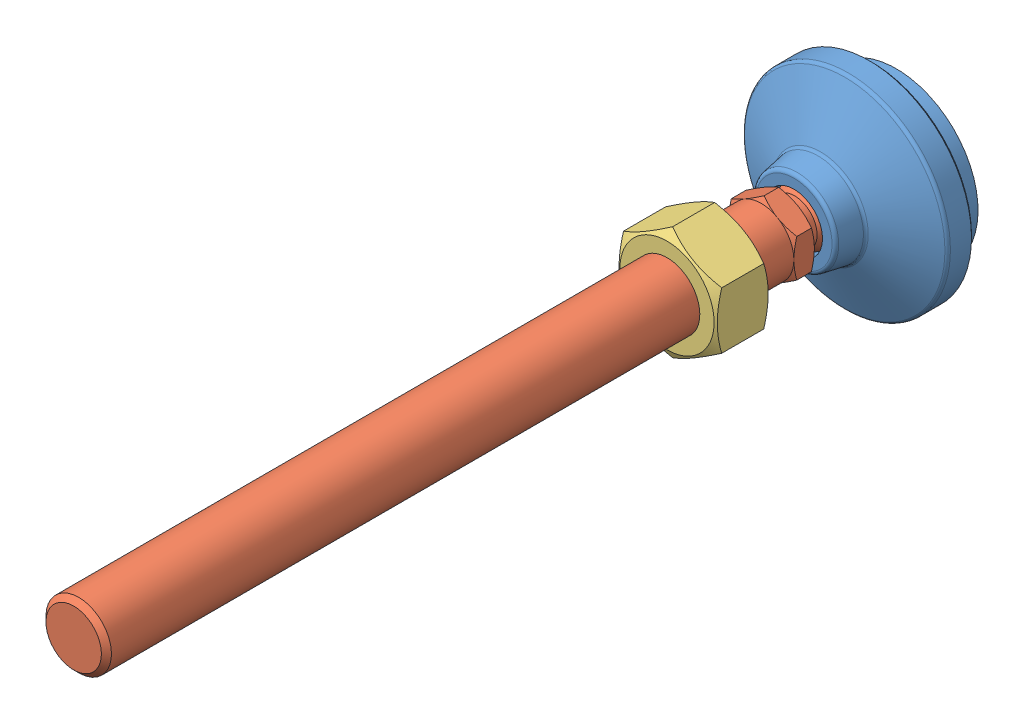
SolidWorks assembly LSVA50-M16X168.sldasm, configuration Default (file format 15000). Lengths in mm.
Overall size (50 50 201).
3 component instances, 3 part files, 0 mates.
Components (placement in the parent):
- LSVA50-M16X168_01-1: LSVA50-M16X168_01.sldprt [ﾃﾞﾌｫﾙﾄ] at (0 0 6) x (1 0 0) z (0 -1 0) size (50 25 50)
- LSVA50-M16X168_02-1: LSVA50-M16X168_02.sldprt [ﾃﾞﾌｫﾙﾄ] at (0 0 13.5) x (1 0 0) z (0 -1 0) size (16 187.5 18.48)
- LSVA50-M16X168_03-1: LSVA50-M16X168_03.sldprt [ﾃﾞﾌｫﾙﾄ] at (0 0 43) size (24 27.71 13)
